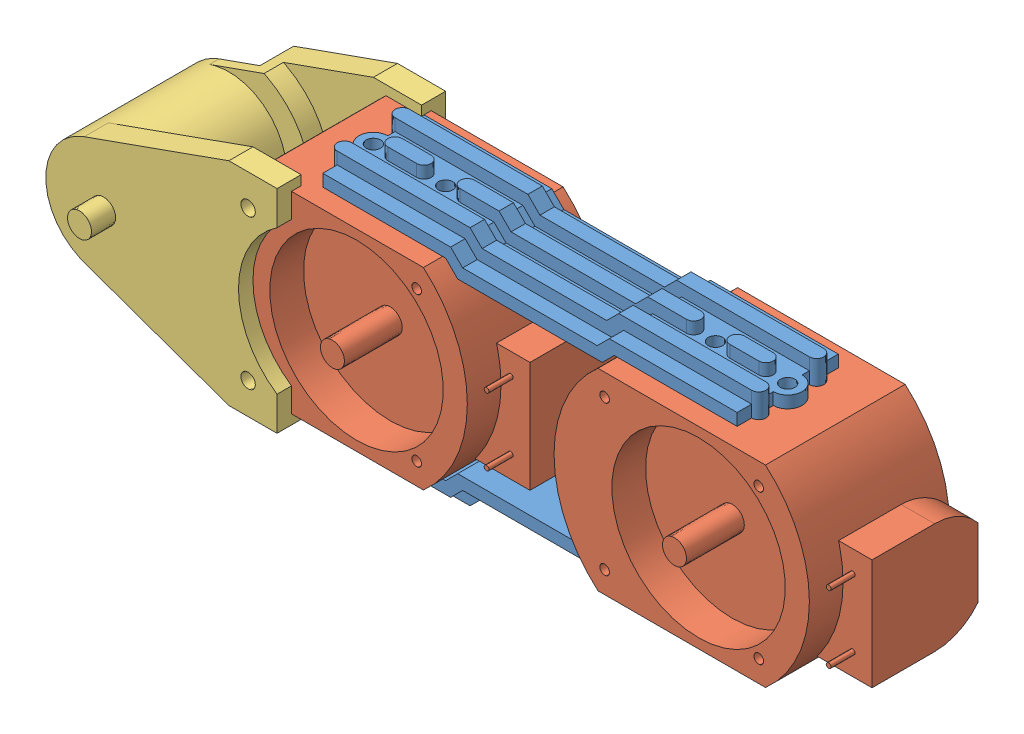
SolidWorks assembly RDM - M3 - M4.sldasm, configuration Predeterminado (file format 6000). Lengths in mm.
Overall size (161.5 50 42).
5 component instances, 3 part files, 0 mates.
Components (placement in the parent):
- RDM - Brazo M3 - M4-1: RDM - Brazo M3 - M4.sldprt [Predeterminado] at origin size (92 7.5 21)
- RDM - Motor-1: RDM - Motor.sldprt [Predeterminado] at (39 -17.5 14.5) x (0 1 0) z (0 0 1) size (40 59 39)
- RDM - Motor-2: RDM - Motor.sldprt [Predeterminado] at (-32 -17.5 14.5) x (0 1 0) z (0 0 1) size (40 59 39)
- RDM - Brazo M3 - M4-2: RDM - Brazo M3 - M4.sldprt [Predeterminado] at (0 -35 0) x (1 0 0) z (0 0 -1) size (92 7.5 21)
- RDM - Base M4-1: RDM - Base M4.sldprt [Predeterminado] at (-81.5 -17.5 0) x (0 0 1) z (0 -1 0) size (40 48 44)
